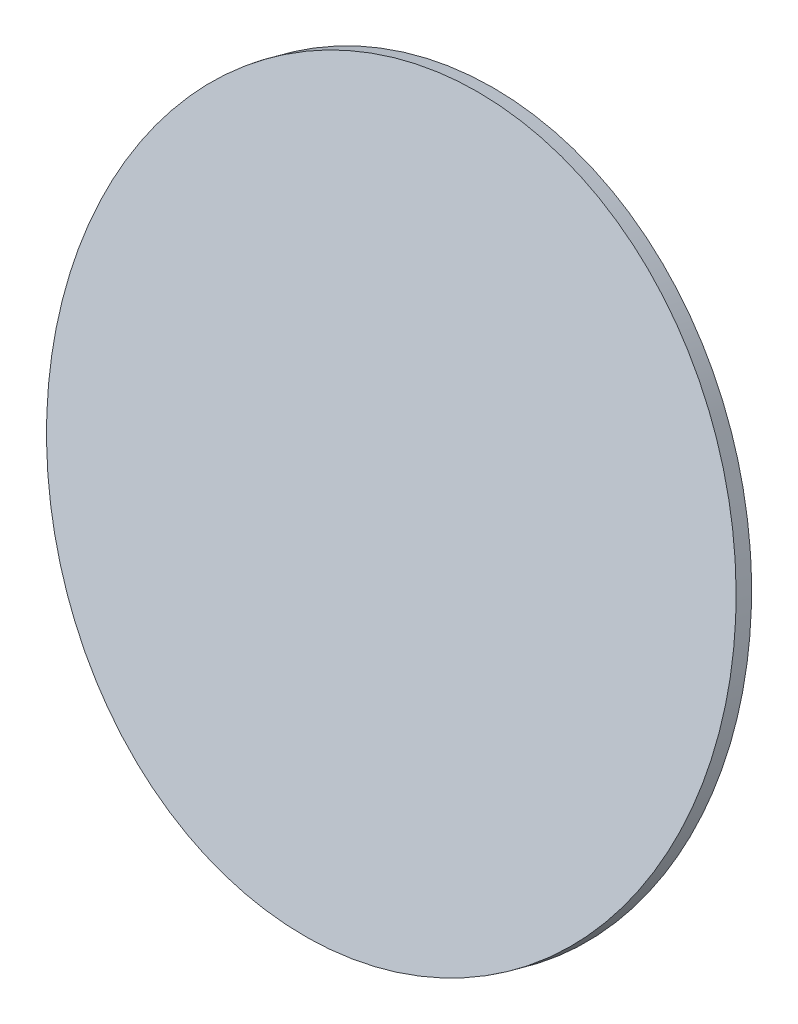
ISO-10303-21;
HEADER;
FILE_DESCRIPTION(('STEP AP214'),'2;1');
FILE_NAME('part.step','',(''),(''),'','','');
FILE_SCHEMA(('AUTOMOTIVE_DESIGN { 1 0 10303 214 1 1 1 1 }'));
ENDSEC;
DATA;
#1=APPLICATION_CONTEXT('core data for automotive mechanical design processes');
#2=APPLICATION_PROTOCOL_DEFINITION('international standard','automotive_design',2000,#1);
#3=PRODUCT_CONTEXT('',#1,'mechanical');
#4=PRODUCT('Part','Part','',(#3));
#5=PRODUCT_RELATED_PRODUCT_CATEGORY('part','',(#4));
#6=PRODUCT_DEFINITION_FORMATION('','',#4);
#7=PRODUCT_DEFINITION_CONTEXT('part definition',#1,'design');
#8=PRODUCT_DEFINITION('design','',#6,#7);
#9=PRODUCT_DEFINITION_SHAPE('','',#8);
#10=(LENGTH_UNIT() NAMED_UNIT(*) SI_UNIT(.MILLI.,.METRE.));
#11=(NAMED_UNIT(*) PLANE_ANGLE_UNIT() SI_UNIT($,.RADIAN.));
#12=(NAMED_UNIT(*) SI_UNIT($,.STERADIAN.) SOLID_ANGLE_UNIT());
#13=UNCERTAINTY_MEASURE_WITH_UNIT(LENGTH_MEASURE(1.E-05),#10,'distance_accuracy_value','');
#14=(GEOMETRIC_REPRESENTATION_CONTEXT(3) GLOBAL_UNCERTAINTY_ASSIGNED_CONTEXT((#13)) GLOBAL_UNIT_ASSIGNED_CONTEXT((#10,
#11,#12)) REPRESENTATION_CONTEXT('',''));
#15=CARTESIAN_POINT('',(0.,0.,0.));
#16=DIRECTION('',(0.,0.,1.));
#17=DIRECTION('',(1.,0.,0.));
#18=AXIS2_PLACEMENT_3D('',#15,#16,#17);
#19=CARTESIAN_POINT('',(16.7174292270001,101.217541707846,-79.615895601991));
#20=CARTESIAN_POINT('',(18.0849751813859,101.217541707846,-79.615895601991));
#21=CARTESIAN_POINT('',(20.8200670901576,100.957337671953,-79.5461741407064));
#22=CARTESIAN_POINT('',(24.7650428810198,99.8014187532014,-79.2364465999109));
#23=CARTESIAN_POINT('',(28.4007533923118,97.9243082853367,-78.7334763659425));
#24=CARTESIAN_POINT('',(31.5874803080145,95.3981425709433,-78.0565923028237));
#25=CARTESIAN_POINT('',(34.2027594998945,92.3200007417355,-77.231806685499));
#26=CARTESIAN_POINT('',(36.1460872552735,88.808174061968,-76.2908155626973));
#27=CARTESIAN_POINT('',(37.3427825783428,84.997620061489,-75.2697806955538));
#28=CARTESIAN_POINT('',(37.7468571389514,81.0347761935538,-74.2079398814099));
#29=CARTESIAN_POINT('',(37.3427825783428,77.0719323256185,-73.1460990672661));
#30=CARTESIAN_POINT('',(36.1460872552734,73.2613783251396,-72.1250642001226));
#31=CARTESIAN_POINT('',(34.2027594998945,69.749551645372,-71.1840730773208));
#32=CARTESIAN_POINT('',(31.5874803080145,66.6714098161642,-70.3592874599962));
#33=CARTESIAN_POINT('',(28.4007533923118,64.1452441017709,-69.6824033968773));
#34=CARTESIAN_POINT('',(24.7650428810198,62.268133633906,-69.1794331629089));
#35=CARTESIAN_POINT('',(20.8200670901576,61.112214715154,-68.8697056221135));
#36=CARTESIAN_POINT('',(16.717429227,60.7219086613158,-68.7651234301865));
#37=CARTESIAN_POINT('',(12.6147913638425,61.112214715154,-68.8697056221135));
#38=CARTESIAN_POINT('',(8.66981557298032,62.268133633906,-69.1794331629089));
#39=CARTESIAN_POINT('',(5.03410506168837,64.1452441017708,-69.6824033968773));
#40=CARTESIAN_POINT('',(1.84737814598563,66.6714098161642,-70.3592874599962));
#41=CARTESIAN_POINT('',(-0.767901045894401,69.749551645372,-71.1840730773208));
#42=CARTESIAN_POINT('',(-2.71122880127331,73.2613783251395,-72.1250642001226));
#43=CARTESIAN_POINT('',(-3.90792412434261,77.0719323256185,-73.1460990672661));
#44=CARTESIAN_POINT('',(-4.31199868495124,81.0347761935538,-74.2079398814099));
#45=CARTESIAN_POINT('',(-3.90792412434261,84.997620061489,-75.2697806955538));
#46=CARTESIAN_POINT('',(-2.71122880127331,88.808174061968,-76.2908155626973));
#47=CARTESIAN_POINT('',(-0.767901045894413,92.3200007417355,-77.2318066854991));
#48=CARTESIAN_POINT('',(1.84737814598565,95.3981425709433,-78.0565923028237));
#49=CARTESIAN_POINT('',(5.03410506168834,97.9243082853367,-78.7334763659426));
#50=CARTESIAN_POINT('',(8.66981557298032,99.8014187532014,-79.2364465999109));
#51=CARTESIAN_POINT('',(12.6147913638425,100.957337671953,-79.5461741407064));
#52=CARTESIAN_POINT('',(15.3498832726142,101.217541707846,-79.615895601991));
#53=CARTESIAN_POINT('',(16.7174292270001,101.217541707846,-79.615895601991));
#54=B_SPLINE_CURVE_WITH_KNOTS('',3,(#19,#20,#21,#22,#23,#24,#25,#26,#27,#28,#29,#30,#31,#32,#33,
#34,#35,#36,#37,#38,#39,#40,#41,#42,#43,#44,#45,#46,#47,#48,#49,#50,#51,#52,#53),.UNSPECIFIED.,
.T.,.F.,(4,1,1,1,1,1,1,1,1,1,1,1,1,1,1,1,1,1,1,1,1,1,1,1,1,1,1,1,1,1,1,1,4),(0.,0.03125,0.0625,
0.09375,0.125,0.15625,0.1875,0.21875,0.25,0.28125,0.3125,0.34375,0.375,0.40625,0.4375,0.46875,
0.5,0.53125,0.5625,0.59375,0.625,0.65625,0.6875,0.71875,0.75,0.78125,0.8125,0.84375,0.875,
0.90625,0.9375,0.96875,1.),.UNSPECIFIED.);
#55=DIRECTION('',(0.,-0.258819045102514,-0.96592582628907));
#56=VECTOR('',#55,1.);
#57=SURFACE_OF_LINEAR_EXTRUSION('',#54,#56);
#58=CARTESIAN_POINT('',(16.717429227,101.217541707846,-79.615895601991));
#59=CARTESIAN_POINT('',(16.9909395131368,101.217541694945,-79.6158955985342));
#60=CARTESIAN_POINT('',(17.2644486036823,101.212337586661,-79.6145011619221));
#61=CARTESIAN_POINT('',(17.8110463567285,101.191561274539,-79.6089341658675));
#62=CARTESIAN_POINT('',(18.0841350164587,101.175989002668,-79.6047615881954));
#63=CARTESIAN_POINT('',(18.6294711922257,101.134516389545,-79.5936490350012));
#64=CARTESIAN_POINT('',(18.9017187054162,101.108616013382,-79.5867090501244));
#65=CARTESIAN_POINT('',(19.4449525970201,101.046527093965,-79.5700723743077));
#66=CARTESIAN_POINT('',(19.7159389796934,101.010338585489,-79.5603756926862));
#67=CARTESIAN_POINT('',(20.2562306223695,100.927713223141,-79.538236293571));
#68=CARTESIAN_POINT('',(20.5255358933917,100.881276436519,-79.5257935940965));
#69=CARTESIAN_POINT('',(21.0620442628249,100.778194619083,-79.4981729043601));
#70=CARTESIAN_POINT('',(21.3292473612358,100.721549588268,-79.4829949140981));
#71=CARTESIAN_POINT('',(21.8611465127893,100.598170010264,-79.4499354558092));
#72=CARTESIAN_POINT('',(22.1258425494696,100.53143539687,-79.4320539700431));
#73=CARTESIAN_POINT('',(22.6523238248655,100.387995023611,-79.3936192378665));
#74=CARTESIAN_POINT('',(22.9141090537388,100.311289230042,-79.3730659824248));
#75=CARTESIAN_POINT('',(23.4343646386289,100.148024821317,-79.3293194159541));
#76=CARTESIAN_POINT('',(23.6928350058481,100.061466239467,-79.3061261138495));
#77=CARTESIAN_POINT('',(24.206057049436,99.8786144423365,-79.2571311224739));
#78=CARTESIAN_POINT('',(24.4608087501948,99.7823212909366,-79.2313294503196));
#79=CARTESIAN_POINT('',(24.9661885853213,99.5801190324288,-79.1771495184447));
#80=CARTESIAN_POINT('',(25.2168167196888,99.474209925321,-79.1487712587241));
#81=CARTESIAN_POINT('',(25.7135763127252,99.2529684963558,-79.0894897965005));
#82=CARTESIAN_POINT('',(25.9597077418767,99.1376361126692,-79.0585865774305));
#83=CARTESIAN_POINT('',(26.4471018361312,98.8977403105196,-78.9943066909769));
#84=CARTESIAN_POINT('',(26.6883644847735,98.7731768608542,-78.9609300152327));
#85=CARTESIAN_POINT('',(27.1656486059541,98.5150111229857,-78.8917547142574));
#86=CARTESIAN_POINT('',(27.4016700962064,98.3814088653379,-78.8559560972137));
#87=CARTESIAN_POINT('',(27.868099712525,98.1053575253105,-78.7819883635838));
#88=CARTESIAN_POINT('',(28.0985078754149,97.9629085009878,-78.743819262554));
#89=CARTESIAN_POINT('',(28.5533377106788,97.6693563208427,-78.6651621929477));
#90=CARTESIAN_POINT('',(28.777759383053,97.5182531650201,-78.6246742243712));
#91=CARTESIAN_POINT('',(29.2202892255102,97.2076520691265,-78.5414489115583));
#92=CARTESIAN_POINT('',(29.4383973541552,97.0481540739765,-78.4987115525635));
#93=CARTESIAN_POINT('',(29.8679739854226,96.7210219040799,-78.4110567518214));
#94=CARTESIAN_POINT('',(30.0794424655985,96.5533877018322,-78.3661393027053));
#95=CARTESIAN_POINT('',(30.4954133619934,96.2102417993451,-78.2741936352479));
#96=CARTESIAN_POINT('',(30.6999158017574,96.0347301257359,-78.2271654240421));
#97=CARTESIAN_POINT('',(31.1016283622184,95.6760877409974,-78.1310674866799));
#98=CARTESIAN_POINT('',(31.2988385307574,95.4929570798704,-78.0819977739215));
#99=CARTESIAN_POINT('',(31.685639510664,95.1193360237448,-77.9818863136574));
#100=CARTESIAN_POINT('',(31.8752303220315,94.9288456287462,-77.9308445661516));
#101=CARTESIAN_POINT('',(32.2465242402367,94.5408210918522,-77.8268737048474));
#102=CARTESIAN_POINT('',(32.4282272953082,94.3432869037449,-77.7739445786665));
#103=CARTESIAN_POINT('',(32.7834780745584,93.9414898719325,-77.6662833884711));
#104=CARTESIAN_POINT('',(32.9570257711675,93.7372270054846,-77.6115513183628));
#105=CARTESIAN_POINT('',(33.2956979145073,93.3222878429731,-77.5003687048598));
#106=CARTESIAN_POINT('',(33.4608223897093,93.1116115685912,-77.4439181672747));
#107=CARTESIAN_POINT('',(33.7823803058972,92.6841605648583,-77.3293830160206));
#108=CARTESIAN_POINT('',(33.9388138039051,92.4673858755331,-77.2712984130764));
#109=CARTESIAN_POINT('',(34.2427213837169,92.0280539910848,-77.1535797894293));
#110=CARTESIAN_POINT('',(34.3901954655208,91.8054967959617,-77.0939457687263));
#111=CARTESIAN_POINT('',(34.6759848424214,91.3549603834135,-76.9732249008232));
#112=CARTESIAN_POINT('',(34.8143000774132,91.1269811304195,-76.9121380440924));
#113=CARTESIAN_POINT('',(35.0815729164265,90.6659600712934,-76.7886078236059));
#114=CARTESIAN_POINT('',(35.2105304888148,90.4329182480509,-76.7261644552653));
#115=CARTESIAN_POINT('',(35.4588888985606,89.9621317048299,-76.6000175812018));
#116=CARTESIAN_POINT('',(35.5782897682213,89.7243870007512,-76.5363140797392));
#117=CARTESIAN_POINT('',(35.8073357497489,89.2445540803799,-76.4077432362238));
#118=CARTESIAN_POINT('',(35.9169809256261,89.0024658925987,-76.3428759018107));
#119=CARTESIAN_POINT('',(36.1263161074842,88.5143064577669,-76.2120739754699));
#120=CARTESIAN_POINT('',(36.2260061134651,88.2682352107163,-76.1461393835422));
#121=CARTESIAN_POINT('',(36.4153082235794,87.7725007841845,-76.0133077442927));
#122=CARTESIAN_POINT('',(36.5049202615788,87.5228375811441,-75.9464106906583));
#123=CARTESIAN_POINT('',(36.6739440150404,87.020309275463,-75.8117586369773));
#124=CARTESIAN_POINT('',(36.7533556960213,86.7674441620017,-75.7440036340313));
#125=CARTESIAN_POINT('',(36.9018560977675,86.258902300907,-75.6077402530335));
#126=CARTESIAN_POINT('',(36.9709448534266,86.0032255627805,-75.5392318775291));
#127=CARTESIAN_POINT('',(37.0986767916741,85.4894504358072,-75.4015662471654));
#128=CARTESIAN_POINT('',(37.1573200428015,85.2313520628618,-75.3324089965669));
#129=CARTESIAN_POINT('',(37.2640381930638,84.7131247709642,-75.1935504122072));
#130=CARTESIAN_POINT('',(37.3121130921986,84.452995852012,-75.123849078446));
#131=CARTESIAN_POINT('',(37.3976531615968,83.931114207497,-74.9840113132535));
#132=CARTESIAN_POINT('',(37.4351182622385,83.6693614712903,-74.9138748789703));
#133=CARTESIAN_POINT('',(37.4993974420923,83.1446378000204,-74.7732755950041));
#134=CARTESIAN_POINT('',(37.5262114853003,82.8816668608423,-74.7028127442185));
#135=CARTESIAN_POINT('',(37.5691470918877,82.3549126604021,-74.5616693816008));
#136=CARTESIAN_POINT('',(37.5852686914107,82.0911294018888,-74.4909888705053));
#137=CARTESIAN_POINT('',(37.6067779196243,81.5631561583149,-74.3495188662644));
#138=CARTESIAN_POINT('',(37.6121656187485,81.2989661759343,-74.2787293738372));
#139=CARTESIAN_POINT('',(37.6121656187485,80.7705862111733,-74.1371503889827));
#140=CARTESIAN_POINT('',(37.6067779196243,80.5063962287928,-74.0663608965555));
#141=CARTESIAN_POINT('',(37.5852686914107,79.9784229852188,-73.9248908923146));
#142=CARTESIAN_POINT('',(37.5691470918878,79.7146397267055,-73.8542103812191));
#143=CARTESIAN_POINT('',(37.5262114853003,79.1878855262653,-73.7130670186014));
#144=CARTESIAN_POINT('',(37.4993974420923,78.9249145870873,-73.6426041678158));
#145=CARTESIAN_POINT('',(37.4351182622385,78.4001909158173,-73.5020048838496));
#146=CARTESIAN_POINT('',(37.3976531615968,78.1384381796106,-73.4318684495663));
#147=CARTESIAN_POINT('',(37.3121130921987,77.6165565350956,-73.2920306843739));
#148=CARTESIAN_POINT('',(37.2640381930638,77.3564276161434,-73.2223293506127));
#149=CARTESIAN_POINT('',(37.1573200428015,76.8382003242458,-73.083470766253));
#150=CARTESIAN_POINT('',(37.0986767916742,76.5801019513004,-73.0143135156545));
#151=CARTESIAN_POINT('',(36.9709448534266,76.0663268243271,-72.8766478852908));
#152=CARTESIAN_POINT('',(36.9018560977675,75.8106500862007,-72.8081395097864));
#153=CARTESIAN_POINT('',(36.7533556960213,75.3021082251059,-72.6718761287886));
#154=CARTESIAN_POINT('',(36.6739440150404,75.0492431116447,-72.6041211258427));
#155=CARTESIAN_POINT('',(36.5049202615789,74.5467148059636,-72.4694690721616));
#156=CARTESIAN_POINT('',(36.4153082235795,74.2970516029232,-72.4025720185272));
#157=CARTESIAN_POINT('',(36.2260061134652,73.8013171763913,-72.2697403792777));
#158=CARTESIAN_POINT('',(36.1263161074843,73.5552459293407,-72.20380578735));
#159=CARTESIAN_POINT('',(35.9169809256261,73.067086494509,-72.0730038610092));
#160=CARTESIAN_POINT('',(35.8073357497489,72.8249983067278,-72.0081365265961));
#161=CARTESIAN_POINT('',(35.5782897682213,72.3451653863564,-71.8795656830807));
#162=CARTESIAN_POINT('',(35.4588888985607,72.1074206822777,-71.815862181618));
#163=CARTESIAN_POINT('',(35.2105304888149,71.6366341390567,-71.6897153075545));
#164=CARTESIAN_POINT('',(35.0815729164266,71.4035923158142,-71.627271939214));
#165=CARTESIAN_POINT('',(34.8143000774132,70.9425712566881,-71.5037417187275));
#166=CARTESIAN_POINT('',(34.6759848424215,70.7145920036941,-71.4426548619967));
#167=CARTESIAN_POINT('',(34.3901954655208,70.264055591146,-71.3219339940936));
#168=CARTESIAN_POINT('',(34.2427213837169,70.0414983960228,-71.2622999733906));
#169=CARTESIAN_POINT('',(33.9388138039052,69.6021665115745,-71.1445813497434));
#170=CARTESIAN_POINT('',(33.7823803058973,69.3853918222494,-71.0864967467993));
#171=CARTESIAN_POINT('',(33.4608223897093,68.9579408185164,-70.9719615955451));
#172=CARTESIAN_POINT('',(33.2956979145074,68.7472645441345,-70.9155110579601));
#173=CARTESIAN_POINT('',(32.9570257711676,68.3323253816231,-70.8043284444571));
#174=CARTESIAN_POINT('',(32.7834780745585,68.1280625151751,-70.7495963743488));
#175=CARTESIAN_POINT('',(32.4282272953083,67.7262654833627,-70.6419351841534));
#176=CARTESIAN_POINT('',(32.2465242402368,67.5287312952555,-70.5890060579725));
#177=CARTESIAN_POINT('',(31.8752303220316,67.1407067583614,-70.4850351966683));
#178=CARTESIAN_POINT('',(31.685639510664,66.9502163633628,-70.4339934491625));
#179=CARTESIAN_POINT('',(31.2988385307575,66.5765953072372,-70.3338819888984));
#180=CARTESIAN_POINT('',(31.1016283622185,66.3934646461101,-70.28481227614));
#181=CARTESIAN_POINT('',(30.6999158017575,66.0348222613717,-70.1887143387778));
#182=CARTESIAN_POINT('',(30.4954133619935,65.8593105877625,-70.141686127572));
#183=CARTESIAN_POINT('',(30.0794424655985,65.5161646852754,-70.0497404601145));
#184=CARTESIAN_POINT('',(29.8679739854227,65.3485304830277,-70.0048230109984));
#185=CARTESIAN_POINT('',(29.4383973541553,65.0213983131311,-69.9171682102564));
#186=CARTESIAN_POINT('',(29.2202892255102,64.8619003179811,-69.8744308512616));
#187=CARTESIAN_POINT('',(28.7777593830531,64.5512992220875,-69.7912055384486));
#188=CARTESIAN_POINT('',(28.5533377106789,64.4001960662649,-69.7507175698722));
#189=CARTESIAN_POINT('',(28.098507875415,64.1066438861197,-69.6720605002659));
#190=CARTESIAN_POINT('',(27.8680997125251,63.9641948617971,-69.633891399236));
#191=CARTESIAN_POINT('',(27.4016700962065,63.6881435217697,-69.5599236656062));
#192=CARTESIAN_POINT('',(27.1656486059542,63.5545412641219,-69.5241250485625));
#193=CARTESIAN_POINT('',(26.6883644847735,63.2963755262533,-69.4549497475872));
#194=CARTESIAN_POINT('',(26.4471018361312,63.1718120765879,-69.4215730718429));
#195=CARTESIAN_POINT('',(25.9597077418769,62.9319162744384,-69.3572931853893));
#196=CARTESIAN_POINT('',(25.7135763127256,62.8165838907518,-69.3263899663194));
#197=CARTESIAN_POINT('',(25.2168167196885,62.5953424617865,-69.2671085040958));
#198=CARTESIAN_POINT('',(24.9661885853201,62.4894333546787,-69.2387302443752));
#199=CARTESIAN_POINT('',(24.4608087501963,62.287231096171,-69.1845503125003));
#200=CARTESIAN_POINT('',(24.206057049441,62.1909379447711,-69.1587486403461));
#201=CARTESIAN_POINT('',(23.6928350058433,62.0080861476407,-69.1097536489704));
#202=CARTESIAN_POINT('',(23.4343646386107,61.9215275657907,-69.0865603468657));
#203=CARTESIAN_POINT('',(22.9141090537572,61.7582631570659,-69.0428137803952));
#204=CARTESIAN_POINT('',(22.6523238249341,61.6815573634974,-69.0222605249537));
#205=CARTESIAN_POINT('',(22.1258425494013,61.5381169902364,-68.9838257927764));
#206=CARTESIAN_POINT('',(21.861146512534,61.4713823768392,-68.9659443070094));
#207=CARTESIAN_POINT('',(21.3292473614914,61.3480027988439,-68.932884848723));
#208=CARTESIAN_POINT('',(21.0620442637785,61.2913577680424,-68.9177068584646));
#209=CARTESIAN_POINT('',(20.5255358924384,61.1882759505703,-68.8900861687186));
#210=CARTESIAN_POINT('',(20.2562306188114,61.1418391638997,-68.8776434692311));
#211=CARTESIAN_POINT('',(19.7159389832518,61.0592138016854,-68.8555040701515));
#212=CARTESIAN_POINT('',(19.4449526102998,61.0230252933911,-68.8458073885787));
#213=CARTESIAN_POINT('',(18.9017186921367,60.9609363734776,-68.829170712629));
#214=CARTESIAN_POINT('',(18.6294711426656,60.9350359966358,-68.8222307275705));
#215=CARTESIAN_POINT('',(18.0841350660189,60.8935633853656,-68.8111181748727));
#216=CARTESIAN_POINT('',(17.8110465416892,60.8779911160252,-68.8069455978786));
#217=CARTESIAN_POINT('',(17.2644484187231,60.8572147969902,-68.8013785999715));
#218=CARTESIAN_POINT('',(16.9909388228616,60.8520106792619,-68.7999841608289));
#219=CARTESIAN_POINT('',(16.4439196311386,60.8520106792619,-68.7999841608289));
#220=CARTESIAN_POINT('',(16.1704100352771,60.8572147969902,-68.8013785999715));
#221=CARTESIAN_POINT('',(15.6238119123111,60.8779911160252,-68.8069455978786));
#222=CARTESIAN_POINT('',(15.3507233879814,60.8935633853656,-68.8111181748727));
#223=CARTESIAN_POINT('',(14.8053873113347,60.9350359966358,-68.8222307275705));
#224=CARTESIAN_POINT('',(14.5331397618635,60.9609363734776,-68.829170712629));
#225=CARTESIAN_POINT('',(13.9899058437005,61.0230252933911,-68.8458073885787));
#226=CARTESIAN_POINT('',(13.7189194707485,61.0592138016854,-68.8555040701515));
#227=CARTESIAN_POINT('',(13.1786278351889,61.1418391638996,-68.8776434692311));
#228=CARTESIAN_POINT('',(12.9093225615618,61.1882759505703,-68.8900861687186));
#229=CARTESIAN_POINT('',(12.3728141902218,61.2913577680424,-68.9177068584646));
#230=CARTESIAN_POINT('',(12.1056110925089,61.3480027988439,-68.932884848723));
#231=CARTESIAN_POINT('',(11.5737119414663,61.4713823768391,-68.9659443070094));
#232=CARTESIAN_POINT('',(11.309015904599,61.5381169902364,-68.9838257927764));
#233=CARTESIAN_POINT('',(10.7825346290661,61.6815573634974,-69.0222605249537));
#234=CARTESIAN_POINT('',(10.520749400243,61.7582631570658,-69.0428137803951));
#235=CARTESIAN_POINT('',(10.0004938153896,61.9215275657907,-69.0865603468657));
#236=CARTESIAN_POINT('',(9.74202344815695,62.0080861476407,-69.1097536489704));
#237=CARTESIAN_POINT('',(9.22880140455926,62.1909379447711,-69.158748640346));
#238=CARTESIAN_POINT('',(8.97404970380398,62.2872310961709,-69.1845503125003));
#239=CARTESIAN_POINT('',(8.46866986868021,62.4894333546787,-69.2387302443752));
#240=CARTESIAN_POINT('',(8.21804173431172,62.5953424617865,-69.2671085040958));
#241=CARTESIAN_POINT('',(7.72128214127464,62.8165838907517,-69.3263899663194));
#242=CARTESIAN_POINT('',(7.47515071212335,62.9319162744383,-69.3572931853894));
#243=CARTESIAN_POINT('',(6.98775661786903,63.1718120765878,-69.4215730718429));
#244=CARTESIAN_POINT('',(6.74649396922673,63.2963755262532,-69.4549497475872));
#245=CARTESIAN_POINT('',(6.26920984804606,63.5545412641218,-69.5241250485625));
#246=CARTESIAN_POINT('',(6.03318835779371,63.6881435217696,-69.5599236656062));
#247=CARTESIAN_POINT('',(5.56675874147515,63.964194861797,-69.633891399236));
#248=CARTESIAN_POINT('',(5.33635057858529,64.1066438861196,-69.6720605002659));
#249=CARTESIAN_POINT('',(4.8815207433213,64.4001960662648,-69.7507175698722));
#250=CARTESIAN_POINT('',(4.65709907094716,64.5512992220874,-69.7912055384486));
#251=CARTESIAN_POINT('',(4.21456922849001,64.861900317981,-69.8744308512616));
#252=CARTESIAN_POINT('',(3.99646109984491,65.021398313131,-69.9171682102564));
#253=CARTESIAN_POINT('',(3.56688446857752,65.3485304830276,-70.0048230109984));
#254=CARTESIAN_POINT('',(3.3554159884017,65.5161646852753,-70.0497404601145));
#255=CARTESIAN_POINT('',(2.93944509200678,65.8593105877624,-70.141686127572));
#256=CARTESIAN_POINT('',(2.73494265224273,66.0348222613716,-70.1887143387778));
#257=CARTESIAN_POINT('',(2.3332300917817,66.3934646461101,-70.28481227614));
#258=CARTESIAN_POINT('',(2.13601992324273,66.5765953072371,-70.3338819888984));
#259=CARTESIAN_POINT('',(1.74921894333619,66.9502163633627,-70.4339934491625));
#260=CARTESIAN_POINT('',(1.55962813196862,67.1407067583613,-70.4850351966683));
#261=CARTESIAN_POINT('',(1.18833421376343,67.5287312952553,-70.5890060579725));
#262=CARTESIAN_POINT('',(1.00663115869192,67.7262654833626,-70.6419351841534));
#263=CARTESIAN_POINT('',(0.651380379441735,68.128062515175,-70.7495963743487));
#264=CARTESIAN_POINT('',(0.477832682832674,68.3323253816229,-70.8043284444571));
#265=CARTESIAN_POINT('',(0.139160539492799,68.7472645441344,-70.9155110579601));
#266=CARTESIAN_POINT('',(-0.0259639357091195,68.9579408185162,-70.9719615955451));
#267=CARTESIAN_POINT('',(-0.347521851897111,69.3853918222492,-71.0864967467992));
#268=CARTESIAN_POINT('',(-0.503955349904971,69.6021665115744,-71.1445813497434));
#269=CARTESIAN_POINT('',(-0.80786292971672,70.0414983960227,-71.2622999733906));
#270=CARTESIAN_POINT('',(-0.955337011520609,70.2640555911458,-71.3219339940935));
#271=CARTESIAN_POINT('',(-1.24112638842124,70.714592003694,-71.4426548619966));
#272=CARTESIAN_POINT('',(-1.37944162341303,70.942571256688,-71.5037417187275));
#273=CARTESIAN_POINT('',(-1.64671446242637,71.4035923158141,-71.627271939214));
#274=CARTESIAN_POINT('',(-1.77567203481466,71.6366341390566,-71.6897153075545));
#275=CARTESIAN_POINT('',(-2.02403044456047,72.1074206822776,-71.815862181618));
#276=CARTESIAN_POINT('',(-2.14343131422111,72.3451653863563,-71.8795656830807));
#277=CARTESIAN_POINT('',(-2.37247729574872,72.8249983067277,-72.0081365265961));
#278=CARTESIAN_POINT('',(-2.48212247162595,73.0670864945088,-72.0730038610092));
#279=CARTESIAN_POINT('',(-2.69145765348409,73.5552459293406,-72.20380578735));
#280=CARTESIAN_POINT('',(-2.79114765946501,73.8013171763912,-72.2697403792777));
#281=CARTESIAN_POINT('',(-2.98044976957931,74.297051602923,-72.4025720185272));
#282=CARTESIAN_POINT('',(-3.07006180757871,74.5467148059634,-72.4694690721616));
#283=CARTESIAN_POINT('',(-3.23908556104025,75.0492431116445,-72.6041211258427));
#284=CARTESIAN_POINT('',(-3.31849724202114,75.3021082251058,-72.6718761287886));
#285=CARTESIAN_POINT('',(-3.46699764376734,75.8106500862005,-72.8081395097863));
#286=CARTESIAN_POINT('',(-3.53608639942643,76.066326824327,-72.8766478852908));
#287=CARTESIAN_POINT('',(-3.663818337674,76.5801019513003,-73.0143135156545));
#288=CARTESIAN_POINT('',(-3.72246158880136,76.8382003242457,-73.083470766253));
#289=CARTESIAN_POINT('',(-3.82917973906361,77.3564276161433,-73.2223293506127));
#290=CARTESIAN_POINT('',(-3.8772546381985,77.6165565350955,-73.2920306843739));
#291=CARTESIAN_POINT('',(-3.96279470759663,78.1384381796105,-73.4318684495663));
#292=CARTESIAN_POINT('',(-4.00025980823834,78.4001909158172,-73.5020048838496));
#293=CARTESIAN_POINT('',(-4.06453898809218,78.9249145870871,-73.6426041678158));
#294=CARTESIAN_POINT('',(-4.09135303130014,79.1878855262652,-73.7130670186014));
#295=CARTESIAN_POINT('',(-4.13428863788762,79.7146397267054,-73.854210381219));
#296=CARTESIAN_POINT('',(-4.15041023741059,79.9784229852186,-73.9248908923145));
#297=CARTESIAN_POINT('',(-4.17191946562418,80.5063962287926,-74.0663608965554));
#298=CARTESIAN_POINT('',(-4.17730716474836,80.7705862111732,-74.1371503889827));
#299=CARTESIAN_POINT('',(-4.17730716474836,81.2989661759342,-74.2787293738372));
#300=CARTESIAN_POINT('',(-4.17191946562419,81.5631561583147,-74.3495188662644));
#301=CARTESIAN_POINT('',(-4.1504102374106,82.0911294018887,-74.4909888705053));
#302=CARTESIAN_POINT('',(-4.13428863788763,82.354912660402,-74.5616693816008));
#303=CARTESIAN_POINT('',(-4.09135303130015,82.8816668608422,-74.7028127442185));
#304=CARTESIAN_POINT('',(-4.06453898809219,83.1446378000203,-74.7732755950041));
#305=CARTESIAN_POINT('',(-4.00025980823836,83.6693614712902,-74.9138748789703));
#306=CARTESIAN_POINT('',(-3.96279470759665,83.9311142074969,-74.9840113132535));
#307=CARTESIAN_POINT('',(-3.87725463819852,84.4529958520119,-75.123849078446));
#308=CARTESIAN_POINT('',(-3.82917973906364,84.7131247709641,-75.1935504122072));
#309=CARTESIAN_POINT('',(-3.72246158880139,85.2313520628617,-75.3324089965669));
#310=CARTESIAN_POINT('',(-3.66381833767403,85.4894504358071,-75.4015662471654));
#311=CARTESIAN_POINT('',(-3.53608639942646,86.0032255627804,-75.5392318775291));
#312=CARTESIAN_POINT('',(-3.46699764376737,86.2589023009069,-75.6077402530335));
#313=CARTESIAN_POINT('',(-3.31849724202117,86.7674441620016,-75.7440036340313));
#314=CARTESIAN_POINT('',(-3.23908556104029,87.0203092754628,-75.8117586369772));
#315=CARTESIAN_POINT('',(-3.07006180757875,87.5228375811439,-75.9464106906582));
#316=CARTESIAN_POINT('',(-2.98044976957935,87.7725007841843,-76.0133077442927));
#317=CARTESIAN_POINT('',(-2.79114765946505,88.2682352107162,-76.1461393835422));
#318=CARTESIAN_POINT('',(-2.69145765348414,88.5143064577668,-76.2120739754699));
#319=CARTESIAN_POINT('',(-2.482122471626,89.0024658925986,-76.3428759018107));
#320=CARTESIAN_POINT('',(-2.37247729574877,89.2445540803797,-76.4077432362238));
#321=CARTESIAN_POINT('',(-2.14343131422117,89.7243870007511,-76.5363140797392));
#322=CARTESIAN_POINT('',(-2.02403044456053,89.9621317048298,-76.6000175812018));
#323=CARTESIAN_POINT('',(-1.77567203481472,90.4329182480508,-76.7261644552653));
#324=CARTESIAN_POINT('',(-1.64671446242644,90.6659600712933,-76.7886078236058));
#325=CARTESIAN_POINT('',(-1.37944162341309,91.1269811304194,-76.9121380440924));
#326=CARTESIAN_POINT('',(-1.2411263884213,91.3549603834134,-76.9732249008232));
#327=CARTESIAN_POINT('',(-0.955337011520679,91.8054967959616,-77.0939457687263));
#328=CARTESIAN_POINT('',(-0.807862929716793,92.0280539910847,-77.1535797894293));
#329=CARTESIAN_POINT('',(-0.503955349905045,92.467385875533,-77.2712984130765));
#330=CARTESIAN_POINT('',(-0.347521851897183,92.6841605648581,-77.3293830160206));
#331=CARTESIAN_POINT('',(-0.0259639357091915,93.1116115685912,-77.4439181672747));
#332=CARTESIAN_POINT('',(0.139160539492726,93.322287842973,-77.5003687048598));
#333=CARTESIAN_POINT('',(0.477832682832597,93.7372270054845,-77.6115513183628));
#334=CARTESIAN_POINT('',(0.651380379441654,93.9414898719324,-77.6662833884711));
#335=CARTESIAN_POINT('',(1.00663115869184,94.3432869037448,-77.7739445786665));
#336=CARTESIAN_POINT('',(1.18833421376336,94.540821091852,-77.8268737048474));
#337=CARTESIAN_POINT('',(1.55962813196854,94.928845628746,-77.9308445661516));
#338=CARTESIAN_POINT('',(1.74921894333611,95.1193360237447,-77.9818863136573));
#339=CARTESIAN_POINT('',(2.13601992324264,95.4929570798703,-78.0819977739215));
#340=CARTESIAN_POINT('',(2.33323009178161,95.6760877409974,-78.1310674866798));
#341=CARTESIAN_POINT('',(2.73494265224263,96.0347301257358,-78.2271654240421));
#342=CARTESIAN_POINT('',(2.93944509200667,96.210241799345,-78.2741936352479));
#343=CARTESIAN_POINT('',(3.35541598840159,96.5533877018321,-78.3661393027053));
#344=CARTESIAN_POINT('',(3.56688446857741,96.7210219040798,-78.4110567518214));
#345=CARTESIAN_POINT('',(3.99646109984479,97.0481540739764,-78.4987115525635));
#346=CARTESIAN_POINT('',(4.21456922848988,97.2076520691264,-78.5414489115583));
#347=CARTESIAN_POINT('',(4.65709907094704,97.5182531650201,-78.6246742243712));
#348=CARTESIAN_POINT('',(4.88152074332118,97.6693563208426,-78.6651621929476));
#349=CARTESIAN_POINT('',(5.33635057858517,97.9629085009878,-78.7438192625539));
#350=CARTESIAN_POINT('',(5.56675874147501,98.1053575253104,-78.7819883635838));
#351=CARTESIAN_POINT('',(6.03318835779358,98.3814088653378,-78.8559560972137));
#352=CARTESIAN_POINT('',(6.26920984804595,98.5150111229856,-78.8917547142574));
#353=CARTESIAN_POINT('',(6.74649396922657,98.7731768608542,-78.9609300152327));
#354=CARTESIAN_POINT('',(6.9877566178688,98.8977403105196,-78.9943066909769));
#355=CARTESIAN_POINT('',(7.47515071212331,99.1376361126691,-79.0585865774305));
#356=CARTESIAN_POINT('',(7.72128214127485,99.2529684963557,-79.0894897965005));
#357=CARTESIAN_POINT('',(8.21804173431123,99.4742099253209,-79.1487712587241));
#358=CARTESIAN_POINT('',(8.46866986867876,99.5801190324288,-79.1771495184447));
#359=CARTESIAN_POINT('',(8.97404970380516,99.7823212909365,-79.2313294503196));
#360=CARTESIAN_POINT('',(9.22880140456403,99.8786144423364,-79.2571311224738));
#361=CARTESIAN_POINT('',(9.74202344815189,100.061466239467,-79.3061261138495));
#362=CARTESIAN_POINT('',(10.0004938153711,100.148024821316,-79.3293194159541));
#363=CARTESIAN_POINT('',(10.5207494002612,100.311289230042,-79.3730659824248));
#364=CARTESIAN_POINT('',(10.7825346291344,100.387995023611,-79.3936192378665));
#365=CARTESIAN_POINT('',(11.3090159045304,100.53143539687,-79.4320539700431));
#366=CARTESIAN_POINT('',(11.5737119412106,100.598170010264,-79.4499354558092));
#367=CARTESIAN_POINT('',(12.1056110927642,100.721549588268,-79.4829949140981));
#368=CARTESIAN_POINT('',(12.3728141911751,100.778194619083,-79.4981729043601));
#369=CARTESIAN_POINT('',(12.9093225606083,100.881276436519,-79.5257935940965));
#370=CARTESIAN_POINT('',(13.1786278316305,100.927713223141,-79.538236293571));
#371=CARTESIAN_POINT('',(13.7189194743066,101.010338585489,-79.5603756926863));
#372=CARTESIAN_POINT('',(13.9899058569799,101.046527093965,-79.5700723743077));
#373=CARTESIAN_POINT('',(14.5331397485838,101.108616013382,-79.5867090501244));
#374=CARTESIAN_POINT('',(14.8053872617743,101.134516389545,-79.5936490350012));
#375=CARTESIAN_POINT('',(15.3507234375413,101.175989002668,-79.6047615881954));
#376=CARTESIAN_POINT('',(15.6238120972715,101.191561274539,-79.6089341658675));
#377=CARTESIAN_POINT('',(16.1704098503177,101.212337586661,-79.6145011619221));
#378=CARTESIAN_POINT('',(16.4439189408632,101.217541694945,-79.6158955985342));
#379=CARTESIAN_POINT('',(16.717429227,101.217541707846,-79.615895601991));
#380=B_SPLINE_CURVE_WITH_KNOTS('',3,(#58,#59,#60,#61,#62,#63,#64,#65,#66,#67,#68,#69,#70,#71,
#72,#73,#74,#75,#76,#77,#78,#79,#80,#81,#82,#83,#84,#85,#86,#87,#88,#89,#90,#91,#92,#93,#94,#95,
#96,#97,#98,#99,#100,#101,#102,#103,#104,#105,#106,#107,#108,#109,#110,#111,#112,#113,#114,#115,
#116,#117,#118,#119,#120,#121,#122,#123,#124,#125,#126,#127,#128,#129,#130,#131,#132,#133,#134,
#135,#136,#137,#138,#139,#140,#141,#142,#143,#144,#145,#146,#147,#148,#149,#150,#151,#152,#153,
#154,#155,#156,#157,#158,#159,#160,#161,#162,#163,#164,#165,#166,#167,#168,#169,#170,#171,#172,
#173,#174,#175,#176,#177,#178,#179,#180,#181,#182,#183,#184,#185,#186,#187,#188,#189,#190,#191,
#192,#193,#194,#195,#196,#197,#198,#199,#200,#201,#202,#203,#204,#205,#206,#207,#208,#209,#210,
#211,#212,#213,#214,#215,#216,#217,#218,#219,#220,#221,#222,#223,#224,#225,#226,#227,#228,#229,
#230,#231,#232,#233,#234,#235,#236,#237,#238,#239,#240,#241,#242,#243,#244,#245,#246,#247,#248,
#249,#250,#251,#252,#253,#254,#255,#256,#257,#258,#259,#260,#261,#262,#263,#264,#265,#266,#267,
#268,#269,#270,#271,#272,#273,#274,#275,#276,#277,#278,#279,#280,#281,#282,#283,#284,#285,#286,
#287,#288,#289,#290,#291,#292,#293,#294,#295,#296,#297,#298,#299,#300,#301,#302,#303,#304,#305,
#306,#307,#308,#309,#310,#311,#312,#313,#314,#315,#316,#317,#318,#319,#320,#321,#322,#323,#324,
#325,#326,#327,#328,#329,#330,#331,#332,#333,#334,#335,#336,#337,#338,#339,#340,#341,#342,#343,
#344,#345,#346,#347,#348,#349,#350,#351,#352,#353,#354,#355,#356,#357,#358,#359,#360,#361,#362,
#363,#364,#365,#366,#367,#368,#369,#370,#371,#372,#373,#374,#375,#376,#377,#378,#379),
.UNSPECIFIED.,.F.,.F.,(4,2,2,2,2,2,2,2,2,2,2,2,2,2,2,2,2,2,2,2,2,2,2,2,2,2,2,2,2,2,2,2,2,2,2,2,
2,2,2,2,2,2,2,2,2,2,2,2,2,2,2,2,2,2,2,2,2,2,2,2,2,2,2,2,2,2,2,2,2,2,2,2,2,2,2,2,2,2,2,2,2,2,2,2,
2,2,2,2,2,2,2,2,2,2,2,2,2,2,2,2,2,2,2,2,2,2,2,2,2,2,2,2,2,2,2,2,2,2,2,2,2,2,2,2,2,2,2,2,2,2,2,2,
2,2,2,2,2,2,2,2,2,2,2,2,2,2,2,2,2,2,2,2,2,2,2,2,2,2,2,2,4),(0.,0.820476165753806,
1.64095771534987,2.46144203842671,3.28192358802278,4.10239975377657,4.92287591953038,
5.74335746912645,6.56384179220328,7.38432334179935,8.20479950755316,9.02527567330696,
9.84575722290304,10.6662415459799,11.4867230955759,12.3071992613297,13.1276754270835,
13.9481569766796,14.7686412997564,15.5891228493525,16.4095990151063,17.2300751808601,
18.0505567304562,18.871041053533,19.6915226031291,20.5119987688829,21.3324749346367,
22.1529564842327,22.9734408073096,23.7939223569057,24.6143985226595,25.4348746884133,
26.2553562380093,27.0758405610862,27.8963221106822,28.716798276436,29.5372744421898,
30.3577559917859,31.1782403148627,31.9987218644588,32.8191980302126,33.6396741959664,
34.4601557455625,35.2806400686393,36.1011216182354,36.9215977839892,37.742073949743,
38.5625554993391,39.3830398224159,40.203521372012,41.0239975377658,41.8444737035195,
42.6649552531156,43.4854395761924,44.3059211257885,45.1263972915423,45.9468734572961,
46.7673550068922,47.587839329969,48.4083208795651,49.2287970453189,50.0492732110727,
50.8697547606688,51.6902390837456,52.5107206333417,53.3311967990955,54.1516729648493,
54.9721545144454,55.7926388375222,56.6131203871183,57.4335965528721,58.2540727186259,
59.0745542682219,59.8950385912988,60.7155201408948,61.5359963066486,62.3564724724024,
63.1769540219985,63.9974383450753,64.8179198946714,65.6383960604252,66.458872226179,
67.2793537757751,68.0998380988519,68.920319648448,69.7407958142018,70.5612719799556,
71.3817535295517,72.2022378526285,73.0227194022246,73.8431955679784,74.6636717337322,
75.4841532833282,76.304637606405,77.1251191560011,77.9455953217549,78.7660714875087,
79.5865530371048,80.4070373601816,81.2275189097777,82.0479950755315,82.8684712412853,
83.6889527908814,84.5094371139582,85.3299186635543,86.1503948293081,86.9708709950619,
87.791352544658,88.6118368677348,89.4323184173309,90.2527945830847,91.0732707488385,
91.8937522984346,92.7142366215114,93.5347181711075,94.3551943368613,95.1756705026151,
95.9961520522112,96.816636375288,97.637117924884,98.4575940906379,99.2780702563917,
100.098551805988,100.919036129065,101.739517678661,102.559993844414,103.380470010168,
104.200951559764,105.021435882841,105.841917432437,106.662393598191,107.482869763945,
108.303351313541,109.123835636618,109.944317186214,110.764793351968,111.585269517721,
112.405751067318,113.226235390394,114.04671693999,114.867193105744,115.687669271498,
116.508150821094,117.328635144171,118.149116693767,118.969592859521,119.790069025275,
120.610550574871,121.431034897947,122.251516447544,123.071992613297,123.892468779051,
124.712950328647,125.533434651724,126.35391620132,127.174392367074,127.994868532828,
128.815350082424,129.635834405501,130.456315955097,131.276792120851),.UNSPECIFIED.);
#381=CARTESIAN_POINT('',(16.717429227,101.217541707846,-79.615895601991));
#382=VERTEX_POINT('',#381);
#383=EDGE_CURVE('E8',#382,#382,#380,.T.);
#384=ORIENTED_EDGE('',*,*,#383,.T.);
#385=EDGE_LOOP('',(#384));
#386=FACE_BOUND('',#385,.T.);
#387=CARTESIAN_POINT('',(16.717429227,100.958722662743,-80.5818214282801));
#388=CARTESIAN_POINT('',(16.3859010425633,100.958722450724,-80.5818213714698));
#389=CARTESIAN_POINT('',(16.0543750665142,100.951076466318,-80.5797726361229));
#390=CARTESIAN_POINT('',(15.3920718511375,100.920563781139,-80.5715967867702));
#391=CARTESIAN_POINT('',(15.0612946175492,100.897696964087,-80.5654696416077));
#392=CARTESIAN_POINT('',(14.4012380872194,100.836813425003,-80.5491559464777));
#393=CARTESIAN_POINT('',(14.0719587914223,100.798796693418,-80.5389693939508));
#394=CARTESIAN_POINT('',(13.4156449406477,100.707686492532,-80.5145564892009));
#395=CARTESIAN_POINT('',(13.0886103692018,100.65459313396,-80.5003301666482));
#396=CARTESIAN_POINT('',(12.4375373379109,100.533392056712,-80.4678544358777));
#397=CARTESIAN_POINT('',(12.1134988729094,100.46528436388,-80.4496050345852));
#398=CARTESIAN_POINT('',(11.4691422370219,100.31425316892,-80.4091363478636));
#399=CARTESIAN_POINT('',(11.1488240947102,100.231329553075,-80.3869170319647));
#400=CARTESIAN_POINT('',(10.5126265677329,100.050879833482,-80.3385656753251));
#401=CARTESIAN_POINT('',(10.1967471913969,99.9533537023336,-80.3124336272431));
#402=CARTESIAN_POINT('',(9.57014500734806,99.7439119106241,-80.2563138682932));
#403=CARTESIAN_POINT('',(9.25942216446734,99.6319963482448,-80.2263261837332));
#404=CARTESIAN_POINT('',(8.64385868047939,99.3939739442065,-80.1625482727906));
#405=CARTESIAN_POINT('',(8.33901801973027,99.2678671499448,-80.1287580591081));
#406=CARTESIAN_POINT('',(7.73589628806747,99.0017776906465,-80.0574596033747));
#407=CARTESIAN_POINT('',(7.43761526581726,98.8617949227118,-80.0199513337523));
#408=CARTESIAN_POINT('',(6.84827283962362,98.5683018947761,-79.9413101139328));
#409=CARTESIAN_POINT('',(6.55721145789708,98.4147915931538,-79.9001771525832));
#410=CARTESIAN_POINT('',(5.98296957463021,98.0945870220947,-79.8143785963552));
#411=CARTESIAN_POINT('',(5.6997890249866,97.9278928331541,-79.7697130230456));
#412=CARTESIAN_POINT('',(5.14198082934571,97.5816504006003,-79.6769376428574));
#413=CARTESIAN_POINT('',(4.8673531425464,97.4021022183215,-79.6288278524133));
#414=CARTESIAN_POINT('',(4.32726292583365,97.0305724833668,-79.5292767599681));
#415=CARTESIAN_POINT('',(4.06180045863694,96.8385908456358,-79.4778354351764));
#416=CARTESIAN_POINT('',(3.54061548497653,96.4426636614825,-79.371747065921));
#417=CARTESIAN_POINT('',(3.28489301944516,96.2387180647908,-79.3171000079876));
#418=CARTESIAN_POINT('',(2.78376803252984,95.8193234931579,-79.2047235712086));
#419=CARTESIAN_POINT('',(2.53836545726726,95.6038745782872,-79.1469942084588));
#420=CARTESIAN_POINT('',(2.05847153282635,95.1619242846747,-79.0285739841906));
#421=CARTESIAN_POINT('',(1.8239801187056,94.9354229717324,-78.9678831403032));
#422=CARTESIAN_POINT('',(1.36643950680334,94.4718810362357,-78.8436774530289));
#423=CARTESIAN_POINT('',(1.14339037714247,94.2348403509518,-78.7801625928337));
#424=CARTESIAN_POINT('',(0.709201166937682,93.7507907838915,-78.6504619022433));
#425=CARTESIAN_POINT('',(0.498061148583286,93.5037818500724,-78.5842760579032));
#426=CARTESIAN_POINT('',(0.0881671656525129,93.00035582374,-78.4493834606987));
#427=CARTESIAN_POINT('',(-0.11058685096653,92.7439387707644,-78.3806767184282));
#428=CARTESIAN_POINT('',(-0.495222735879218,92.2222516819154,-78.2408910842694));
#429=CARTESIAN_POINT('',(-0.68110469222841,91.9569817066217,-78.1698122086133));
#430=CARTESIAN_POINT('',(-1.03956123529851,91.4181803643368,-78.0254408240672));
#431=CARTESIAN_POINT('',(-1.21213575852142,91.1446489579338,-77.952148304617));
#432=CARTESIAN_POINT('',(-1.54363592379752,90.5899738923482,-77.8035235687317));
#433=CARTESIAN_POINT('',(-1.70256148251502,90.3088301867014,-77.7281913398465));
#434=CARTESIAN_POINT('',(-2.00640782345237,89.7395691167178,-77.5756582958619));
#435=CARTESIAN_POINT('',(-2.15132864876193,89.4514517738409,-77.4984574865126));
#436=CARTESIAN_POINT('',(-2.42680472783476,88.868880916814,-77.3423580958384));
#437=CARTESIAN_POINT('',(-2.55736008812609,88.5744274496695,-77.2634595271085));
#438=CARTESIAN_POINT('',(-2.80377901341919,87.9798387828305,-77.1041399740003));
#439=CARTESIAN_POINT('',(-2.91964252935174,87.6797035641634,-77.0237189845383));
#440=CARTESIAN_POINT('',(-3.13647262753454,87.0744523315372,-76.8615424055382));
#441=CARTESIAN_POINT('',(-3.23743910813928,86.7693362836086,-76.7797868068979));
#442=CARTESIAN_POINT('',(-3.42425440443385,86.1548166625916,-76.6151267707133));
#443=CARTESIAN_POINT('',(-3.51010324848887,85.845413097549,-76.5322223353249));
#444=CARTESIAN_POINT('',(-3.66646224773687,85.2230123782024,-76.3654505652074));
#445=CARTESIAN_POINT('',(-3.73697252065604,84.910015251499,-76.281583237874));
#446=CARTESIAN_POINT('',(-3.86244910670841,84.2811270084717,-76.1130731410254));
#447=CARTESIAN_POINT('',(-3.91741539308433,83.9652358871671,-76.0284303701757));
#448=CARTESIAN_POINT('',(-4.01173962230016,83.3312853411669,-75.8585638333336));
#449=CARTESIAN_POINT('',(-4.05109745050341,83.0132259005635,-75.7733400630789));
#450=CARTESIAN_POINT('',(-4.11412869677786,82.3756604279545,-75.6025049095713));
#451=CARTESIAN_POINT('',(-4.13780212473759,82.0561543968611,-75.516893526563));
#452=CARTESIAN_POINT('',(-4.16939129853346,81.4164179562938,-75.3454766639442));
#453=CARTESIAN_POINT('',(-4.17730716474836,81.0961875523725,-75.2596711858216));
#454=CARTESIAN_POINT('',(-4.17730716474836,80.4557267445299,-75.0880602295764));
#455=CARTESIAN_POINT('',(-4.16939129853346,80.1354963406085,-75.0022547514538));
#456=CARTESIAN_POINT('',(-4.13780212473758,79.4957599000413,-74.830837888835));
#457=CARTESIAN_POINT('',(-4.11412869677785,79.1762538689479,-74.7452265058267));
#458=CARTESIAN_POINT('',(-4.0510974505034,78.5386883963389,-74.5743913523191));
#459=CARTESIAN_POINT('',(-4.01173962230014,78.2206289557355,-74.4891675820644));
#460=CARTESIAN_POINT('',(-3.91741539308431,77.5866784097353,-74.3193010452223));
#461=CARTESIAN_POINT('',(-3.86244910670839,77.2707872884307,-74.2346582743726));
#462=CARTESIAN_POINT('',(-3.73697252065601,76.6418990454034,-74.0661481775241));
#463=CARTESIAN_POINT('',(-3.66646224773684,76.3289019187,-73.9822808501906));
#464=CARTESIAN_POINT('',(-3.51010324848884,75.7065011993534,-73.8155090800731));
#465=CARTESIAN_POINT('',(-3.42425440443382,75.3970976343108,-73.7326046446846));
#466=CARTESIAN_POINT('',(-3.23743910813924,74.7825780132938,-73.5679446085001));
#467=CARTESIAN_POINT('',(-3.13647262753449,74.4774619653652,-73.4861890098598));
#468=CARTESIAN_POINT('',(-2.91964252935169,73.8722107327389,-73.3240124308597));
#469=CARTESIAN_POINT('',(-2.80377901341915,73.5720755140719,-73.2435914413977));
#470=CARTESIAN_POINT('',(-2.55736008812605,72.9774868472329,-73.0842718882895));
#471=CARTESIAN_POINT('',(-2.42680472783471,72.6830333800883,-73.0053733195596));
#472=CARTESIAN_POINT('',(-2.15132864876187,72.1004625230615,-72.8492739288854));
#473=CARTESIAN_POINT('',(-2.00640782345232,71.8123451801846,-72.7720731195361));
#474=CARTESIAN_POINT('',(-1.70256148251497,71.2430841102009,-72.6195400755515));
#475=CARTESIAN_POINT('',(-1.54363592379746,70.9619404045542,-72.5442078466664));
#476=CARTESIAN_POINT('',(-1.21213575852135,70.4072653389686,-72.395583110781));
#477=CARTESIAN_POINT('',(-1.03956123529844,70.1337339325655,-72.3222905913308));
#478=CARTESIAN_POINT('',(-0.681104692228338,69.5949325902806,-72.1779192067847));
#479=CARTESIAN_POINT('',(-0.495222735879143,69.329662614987,-72.1068403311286));
#480=CARTESIAN_POINT('',(-0.110586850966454,68.807975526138,-71.9670546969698));
#481=CARTESIAN_POINT('',(0.088167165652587,68.5515584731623,-71.8983479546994));
#482=CARTESIAN_POINT('',(0.498061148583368,68.04813244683,-71.7634553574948));
#483=CARTESIAN_POINT('',(0.709201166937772,67.8011235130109,-71.6972695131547));
#484=CARTESIAN_POINT('',(1.14339037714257,67.3170739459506,-71.5675688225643));
#485=CARTESIAN_POINT('',(1.36643950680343,67.0800332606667,-71.5040539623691));
#486=CARTESIAN_POINT('',(1.82398011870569,66.61649132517,-71.3798482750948));
#487=CARTESIAN_POINT('',(2.05847153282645,66.3899900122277,-71.3191574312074));
#488=CARTESIAN_POINT('',(2.53836545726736,65.9480397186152,-71.2007372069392));
#489=CARTESIAN_POINT('',(2.78376803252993,65.7325908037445,-71.1430078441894));
#490=CARTESIAN_POINT('',(3.28489301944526,65.3131962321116,-71.0306314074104));
#491=CARTESIAN_POINT('',(3.54061548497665,65.1092506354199,-70.975984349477));
#492=CARTESIAN_POINT('',(4.06180045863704,64.7133234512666,-70.8698959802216));
#493=CARTESIAN_POINT('',(4.32726292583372,64.5213418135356,-70.8184546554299));
#494=CARTESIAN_POINT('',(4.86735314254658,64.1498120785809,-70.7189035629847));
#495=CARTESIAN_POINT('',(5.14198082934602,63.970263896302,-70.6707937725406));
#496=CARTESIAN_POINT('',(5.69978902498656,63.6240214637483,-70.5780183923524));
#497=CARTESIAN_POINT('',(5.98296957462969,63.4573272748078,-70.5333528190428));
#498=CARTESIAN_POINT('',(6.55721145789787,63.1371227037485,-70.4475542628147));
#499=CARTESIAN_POINT('',(6.84827283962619,62.9836124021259,-70.4064213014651));
#500=CARTESIAN_POINT('',(7.43761526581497,62.6901193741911,-70.3277800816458));
#501=CARTESIAN_POINT('',(7.73589628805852,62.5501366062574,-70.2902718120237));
#502=CARTESIAN_POINT('',(8.33901801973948,62.2840471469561,-70.2189733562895));
#503=CARTESIAN_POINT('',(8.6438586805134,62.1579403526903,-70.1851831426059));
#504=CARTESIAN_POINT('',(9.2594221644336,61.9199179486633,-70.1214052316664));
#505=CARTESIAN_POINT('',(9.57014500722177,61.8080023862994,-70.0914175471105));
#506=CARTESIAN_POINT('',(10.1967471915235,61.5985605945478,-70.0352977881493));
#507=CARTESIAN_POINT('',(10.5126265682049,61.5010344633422,-70.0091657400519));
#508=CARTESIAN_POINT('',(11.1488240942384,61.3205847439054,-69.9608143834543));
#509=CARTESIAN_POINT('',(11.469142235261,61.2376611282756,-69.9385950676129));
#510=CARTESIAN_POINT('',(12.1134988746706,61.0866299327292,-69.8981263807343));
#511=CARTESIAN_POINT('',(12.4375373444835,61.0185222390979,-69.8798769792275));
#512=CARTESIAN_POINT('',(13.0886103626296,60.8973211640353,-69.8474012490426));
#513=CARTESIAN_POINT('',(13.4156449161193,60.8442278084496,-69.83317492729));
#514=CARTESIAN_POINT('',(14.0719588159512,60.7531175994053,-69.8087620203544));
#515=CARTESIAN_POINT('',(14.4012381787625,60.7151008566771,-69.7985754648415));
#516=CARTESIAN_POINT('',(15.0612945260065,60.6542173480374,-69.7822617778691));
#517=CARTESIAN_POINT('',(15.3920715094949,60.6313505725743,-69.7761346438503));
#518=CARTESIAN_POINT('',(16.0543754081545,60.6008377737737,-69.7679587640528));
#519=CARTESIAN_POINT('',(16.3859023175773,60.5931916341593,-69.7659099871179));
#520=CARTESIAN_POINT('',(17.048956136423,60.5931916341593,-69.7659099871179));
#521=CARTESIAN_POINT('',(17.3804830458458,60.6008377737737,-69.7679587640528));
#522=CARTESIAN_POINT('',(18.0427869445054,60.6313505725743,-69.7761346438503));
#523=CARTESIAN_POINT('',(18.3735639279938,60.6542173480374,-69.7822617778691));
#524=CARTESIAN_POINT('',(19.0336202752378,60.7151008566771,-69.7985754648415));
#525=CARTESIAN_POINT('',(19.362899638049,60.7531175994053,-69.8087620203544));
#526=CARTESIAN_POINT('',(20.019213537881,60.8442278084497,-69.83317492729));
#527=CARTESIAN_POINT('',(20.3462480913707,60.8973211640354,-69.8474012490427));
#528=CARTESIAN_POINT('',(20.9973211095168,61.0185222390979,-69.8798769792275));
#529=CARTESIAN_POINT('',(21.3213595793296,61.0866299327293,-69.8981263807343));
#530=CARTESIAN_POINT('',(21.9657162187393,61.2376611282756,-69.9385950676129));
#531=CARTESIAN_POINT('',(22.2860343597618,61.3205847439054,-69.9608143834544));
#532=CARTESIAN_POINT('',(22.9222318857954,61.5010344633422,-70.0091657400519));
#533=CARTESIAN_POINT('',(23.2381112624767,61.5985605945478,-70.0352977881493));
#534=CARTESIAN_POINT('',(23.8647134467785,61.8080023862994,-70.0914175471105));
#535=CARTESIAN_POINT('',(24.1754362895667,61.9199179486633,-70.1214052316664));
#536=CARTESIAN_POINT('',(24.7909997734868,62.1579403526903,-70.1851831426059));
#537=CARTESIAN_POINT('',(25.0958404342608,62.2840471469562,-70.2189733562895));
#538=CARTESIAN_POINT('',(25.6989621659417,62.5501366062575,-70.2902718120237));
#539=CARTESIAN_POINT('',(25.9972431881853,62.6901193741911,-70.3277800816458));
#540=CARTESIAN_POINT('',(26.5865856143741,62.9836124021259,-70.4064213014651));
#541=CARTESIAN_POINT('',(26.8776469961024,63.1371227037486,-70.4475542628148));
#542=CARTESIAN_POINT('',(27.4518888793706,63.4573272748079,-70.5333528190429));
#543=CARTESIAN_POINT('',(27.7350694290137,63.6240214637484,-70.5780183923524));
#544=CARTESIAN_POINT('',(28.2928776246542,63.9702638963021,-70.6707937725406));
#545=CARTESIAN_POINT('',(28.5675053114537,64.149812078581,-70.7189035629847));
#546=CARTESIAN_POINT('',(29.1075955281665,64.5213418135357,-70.8184546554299));
#547=CARTESIAN_POINT('',(29.3730579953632,64.7133234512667,-70.8698959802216));
#548=CARTESIAN_POINT('',(29.8942429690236,65.10925063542,-70.975984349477));
#549=CARTESIAN_POINT('',(30.149965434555,65.3131962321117,-71.0306314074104));
#550=CARTESIAN_POINT('',(30.6510904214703,65.7325908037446,-71.1430078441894));
#551=CARTESIAN_POINT('',(30.8964929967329,65.9480397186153,-71.2007372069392));
#552=CARTESIAN_POINT('',(31.3763869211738,66.3899900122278,-71.3191574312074));
#553=CARTESIAN_POINT('',(31.6108783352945,66.6164913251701,-71.3798482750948));
#554=CARTESIAN_POINT('',(32.0684189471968,67.0800332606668,-71.5040539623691));
#555=CARTESIAN_POINT('',(32.2914680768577,67.3170739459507,-71.5675688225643));
#556=CARTESIAN_POINT('',(32.7256572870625,67.801123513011,-71.6972695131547));
#557=CARTESIAN_POINT('',(32.9367973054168,68.0481324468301,-71.7634553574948));
#558=CARTESIAN_POINT('',(33.3466912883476,68.5515584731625,-71.8983479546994));
#559=CARTESIAN_POINT('',(33.5454453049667,68.8079755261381,-71.9670546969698));
#560=CARTESIAN_POINT('',(33.9300811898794,69.3296626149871,-72.1068403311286));
#561=CARTESIAN_POINT('',(34.1159631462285,69.5949325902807,-72.1779192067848));
#562=CARTESIAN_POINT('',(34.4744196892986,70.1337339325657,-72.3222905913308));
#563=CARTESIAN_POINT('',(34.6469942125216,70.4072653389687,-72.395583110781));
#564=CARTESIAN_POINT('',(34.9784943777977,70.9619404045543,-72.5442078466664));
#565=CARTESIAN_POINT('',(35.1374199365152,71.2430841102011,-72.6195400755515));
#566=CARTESIAN_POINT('',(35.4412662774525,71.8123451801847,-72.7720731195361));
#567=CARTESIAN_POINT('',(35.5861871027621,72.1004625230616,-72.8492739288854));
#568=CARTESIAN_POINT('',(35.8616631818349,72.6830333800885,-73.0053733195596));
#569=CARTESIAN_POINT('',(35.9922185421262,72.977486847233,-73.0842718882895));
#570=CARTESIAN_POINT('',(36.2386374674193,73.572075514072,-73.2435914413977));
#571=CARTESIAN_POINT('',(36.3545009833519,73.8722107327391,-73.3240124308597));
#572=CARTESIAN_POINT('',(36.5713310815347,74.4774619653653,-73.4861890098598));
#573=CARTESIAN_POINT('',(36.6722975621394,74.7825780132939,-73.5679446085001));
#574=CARTESIAN_POINT('',(36.859112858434,75.3970976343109,-73.7326046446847));
#575=CARTESIAN_POINT('',(36.944961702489,75.7065011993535,-73.8155090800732));
#576=CARTESIAN_POINT('',(37.101320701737,76.3289019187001,-73.9822808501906));
#577=CARTESIAN_POINT('',(37.1718309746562,76.6418990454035,-74.0661481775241));
#578=CARTESIAN_POINT('',(37.2973075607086,77.2707872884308,-74.2346582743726));
#579=CARTESIAN_POINT('',(37.3522738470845,77.5866784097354,-74.3193010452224));
#580=CARTESIAN_POINT('',(37.4465980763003,78.2206289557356,-74.4891675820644));
#581=CARTESIAN_POINT('',(37.4859559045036,78.538688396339,-74.5743913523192));
#582=CARTESIAN_POINT('',(37.548987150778,79.176253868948,-74.7452265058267));
#583=CARTESIAN_POINT('',(37.5726605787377,79.4957599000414,-74.8308378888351));
#584=CARTESIAN_POINT('',(37.6042497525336,80.1354963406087,-75.0022547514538));
#585=CARTESIAN_POINT('',(37.6121656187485,80.45572674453,-75.0880602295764));
#586=CARTESIAN_POINT('',(37.6121656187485,81.0961875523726,-75.2596711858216));
#587=CARTESIAN_POINT('',(37.6042497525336,81.4164179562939,-75.3454766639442));
#588=CARTESIAN_POINT('',(37.5726605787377,82.0561543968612,-75.516893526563));
#589=CARTESIAN_POINT('',(37.548987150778,82.3756604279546,-75.6025049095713));
#590=CARTESIAN_POINT('',(37.4859559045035,83.0132259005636,-75.7733400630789));
#591=CARTESIAN_POINT('',(37.4465980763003,83.331285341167,-75.8585638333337));
#592=CARTESIAN_POINT('',(37.3522738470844,83.9652358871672,-76.0284303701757));
#593=CARTESIAN_POINT('',(37.2973075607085,84.2811270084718,-76.1130731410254));
#594=CARTESIAN_POINT('',(37.1718309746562,84.9100152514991,-76.281583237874));
#595=CARTESIAN_POINT('',(37.101320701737,85.2230123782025,-76.3654505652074));
#596=CARTESIAN_POINT('',(36.944961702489,85.8454130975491,-76.5322223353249));
#597=CARTESIAN_POINT('',(36.859112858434,86.1548166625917,-76.6151267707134));
#598=CARTESIAN_POINT('',(36.6722975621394,86.7693362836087,-76.779786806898));
#599=CARTESIAN_POINT('',(36.5713310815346,87.0744523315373,-76.8615424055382));
#600=CARTESIAN_POINT('',(36.3545009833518,87.6797035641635,-77.0237189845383));
#601=CARTESIAN_POINT('',(36.2386374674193,87.9798387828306,-77.1041399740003));
#602=CARTESIAN_POINT('',(35.9922185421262,88.5744274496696,-77.2634595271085));
#603=CARTESIAN_POINT('',(35.8616631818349,88.8688809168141,-77.3423580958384));
#604=CARTESIAN_POINT('',(35.586187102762,89.451451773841,-77.4984574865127));
#605=CARTESIAN_POINT('',(35.4412662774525,89.7395691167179,-77.575658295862));
#606=CARTESIAN_POINT('',(35.1374199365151,90.3088301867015,-77.7281913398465));
#607=CARTESIAN_POINT('',(34.9784943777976,90.5899738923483,-77.8035235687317));
#608=CARTESIAN_POINT('',(34.6469942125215,91.1446489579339,-77.952148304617));
#609=CARTESIAN_POINT('',(34.4744196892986,91.4181803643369,-78.0254408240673));
#610=CARTESIAN_POINT('',(34.1159631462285,91.9569817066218,-78.1698122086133));
#611=CARTESIAN_POINT('',(33.9300811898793,92.2222516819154,-78.2408910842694));
#612=CARTESIAN_POINT('',(33.5454453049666,92.7439387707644,-78.3806767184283));
#613=CARTESIAN_POINT('',(33.3466912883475,93.0003558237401,-78.4493834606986));
#614=CARTESIAN_POINT('',(32.9367973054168,93.5037818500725,-78.5842760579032));
#615=CARTESIAN_POINT('',(32.7256572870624,93.7507907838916,-78.6504619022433));
#616=CARTESIAN_POINT('',(32.2914680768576,94.2348403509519,-78.7801625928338));
#617=CARTESIAN_POINT('',(32.0684189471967,94.4718810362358,-78.8436774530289));
#618=CARTESIAN_POINT('',(31.6108783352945,94.9354229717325,-78.9678831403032));
#619=CARTESIAN_POINT('',(31.3763869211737,95.1619242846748,-79.0285739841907));
#620=CARTESIAN_POINT('',(30.8964929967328,95.6038745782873,-79.1469942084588));
#621=CARTESIAN_POINT('',(30.6510904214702,95.819323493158,-79.2047235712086));
#622=CARTESIAN_POINT('',(30.1499654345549,96.2387180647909,-79.3171000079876));
#623=CARTESIAN_POINT('',(29.8942429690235,96.4426636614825,-79.3717470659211));
#624=CARTESIAN_POINT('',(29.3730579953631,96.8385908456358,-79.4778354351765));
#625=CARTESIAN_POINT('',(29.1075955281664,97.0305724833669,-79.5292767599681));
#626=CARTESIAN_POINT('',(28.5675053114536,97.4021022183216,-79.6288278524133));
#627=CARTESIAN_POINT('',(28.2928776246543,97.5816504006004,-79.6769376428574));
#628=CARTESIAN_POINT('',(27.7350694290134,97.9278928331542,-79.7697130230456));
#629=CARTESIAN_POINT('',(27.4518888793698,98.0945870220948,-79.8143785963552));
#630=CARTESIAN_POINT('',(26.8776469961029,98.4147915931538,-79.9001771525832));
#631=CARTESIAN_POINT('',(26.5865856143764,98.5683018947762,-79.9413101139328));
#632=CARTESIAN_POINT('',(25.9972431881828,98.8617949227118,-80.0199513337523));
#633=CARTESIAN_POINT('',(25.6989621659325,99.0017776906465,-80.0574596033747));
#634=CARTESIAN_POINT('',(25.0958404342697,99.2678671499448,-80.1287580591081));
#635=CARTESIAN_POINT('',(24.7909997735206,99.3939739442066,-80.1625482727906));
#636=CARTESIAN_POINT('',(24.1754362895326,99.6319963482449,-80.2263261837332));
#637=CARTESIAN_POINT('',(23.8647134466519,99.7439119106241,-80.2563138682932));
#638=CARTESIAN_POINT('',(23.238111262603,99.9533537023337,-80.3124336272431));
#639=CARTESIAN_POINT('',(22.9222318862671,100.050879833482,-80.3385656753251));
#640=CARTESIAN_POINT('',(22.2860343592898,100.231329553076,-80.3869170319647));
#641=CARTESIAN_POINT('',(21.965716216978,100.31425316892,-80.4091363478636));
#642=CARTESIAN_POINT('',(21.3213595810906,100.46528436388,-80.4496050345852));
#643=CARTESIAN_POINT('',(20.9973211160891,100.533392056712,-80.4678544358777));
#644=CARTESIAN_POINT('',(20.3462480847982,100.65459313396,-80.5003301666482));
#645=CARTESIAN_POINT('',(20.0192135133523,100.707686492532,-80.5145564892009));
#646=CARTESIAN_POINT('',(19.3628996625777,100.798796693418,-80.5389693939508));
#647=CARTESIAN_POINT('',(19.0336203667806,100.836813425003,-80.5491559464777));
#648=CARTESIAN_POINT('',(18.3735638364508,100.897696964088,-80.5654696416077));
#649=CARTESIAN_POINT('',(18.0427866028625,100.920563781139,-80.5715967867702));
#650=CARTESIAN_POINT('',(17.3804833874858,100.951076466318,-80.5797726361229));
#651=CARTESIAN_POINT('',(17.0489574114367,100.958722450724,-80.5818213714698));
#652=CARTESIAN_POINT('',(16.717429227,100.958722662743,-80.5818214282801));
#653=B_SPLINE_CURVE_WITH_KNOTS('',3,(#387,#388,#389,#390,#391,#392,#393,#394,#395,#396,#397,
#398,#399,#400,#401,#402,#403,#404,#405,#406,#407,#408,#409,#410,#411,#412,#413,#414,#415,#416,
#417,#418,#419,#420,#421,#422,#423,#424,#425,#426,#427,#428,#429,#430,#431,#432,#433,#434,#435,
#436,#437,#438,#439,#440,#441,#442,#443,#444,#445,#446,#447,#448,#449,#450,#451,#452,#453,#454,
#455,#456,#457,#458,#459,#460,#461,#462,#463,#464,#465,#466,#467,#468,#469,#470,#471,#472,#473,
#474,#475,#476,#477,#478,#479,#480,#481,#482,#483,#484,#485,#486,#487,#488,#489,#490,#491,#492,
#493,#494,#495,#496,#497,#498,#499,#500,#501,#502,#503,#504,#505,#506,#507,#508,#509,#510,#511,
#512,#513,#514,#515,#516,#517,#518,#519,#520,#521,#522,#523,#524,#525,#526,#527,#528,#529,#530,
#531,#532,#533,#534,#535,#536,#537,#538,#539,#540,#541,#542,#543,#544,#545,#546,#547,#548,#549,
#550,#551,#552,#553,#554,#555,#556,#557,#558,#559,#560,#561,#562,#563,#564,#565,#566,#567,#568,
#569,#570,#571,#572,#573,#574,#575,#576,#577,#578,#579,#580,#581,#582,#583,#584,#585,#586,#587,
#588,#589,#590,#591,#592,#593,#594,#595,#596,#597,#598,#599,#600,#601,#602,#603,#604,#605,#606,
#607,#608,#609,#610,#611,#612,#613,#614,#615,#616,#617,#618,#619,#620,#621,#622,#623,#624,#625,
#626,#627,#628,#629,#630,#631,#632,#633,#634,#635,#636,#637,#638,#639,#640,#641,#642,#643,#644,
#645,#646,#647,#648,#649,#650,#651,#652),.UNSPECIFIED.,.F.,.F.,(4,2,2,2,2,2,2,2,2,2,2,2,2,2,2,2,
2,2,2,2,2,2,2,2,2,2,2,2,2,2,2,2,2,2,2,2,2,2,2,2,2,2,2,2,2,2,2,2,2,2,2,2,2,2,2,2,2,2,2,2,2,2,2,2,
2,2,2,2,2,2,2,2,2,2,2,2,2,2,2,2,2,2,2,2,2,2,2,2,2,2,2,2,2,2,2,2,2,2,2,2,2,2,2,2,2,2,2,2,2,2,2,2,
2,2,2,2,2,2,2,2,2,2,2,2,2,2,2,2,2,2,2,2,4),(0.,0.994487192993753,1.98898198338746,
2.98347740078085,3.9779655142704,4.97245191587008,5.96694595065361,6.96144185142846,
7.95593096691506,8.95041676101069,9.94490993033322,10.9394061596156,11.9338963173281,
12.9283817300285,13.922873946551,14.917370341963,15.9118615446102,16.906346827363,
17.9008380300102,18.8953344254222,19.8898266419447,20.8843120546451,21.8788022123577,
22.87329844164,23.8677916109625,24.8622774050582,25.8567665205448,26.8512624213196,
27.8457564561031,28.8402428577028,29.8347309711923,30.8292263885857,31.8237211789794,
32.8182083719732,33.812695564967,34.8071903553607,35.8016857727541,36.7961738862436,
37.7906602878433,38.7851543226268,39.7796502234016,40.7741393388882,41.7686251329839,
42.7631183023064,43.7576145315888,44.7521046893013,45.7465901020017,46.7410823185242,
47.7355787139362,48.7300699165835,49.7245551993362,50.7190464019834,51.7135427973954,
52.708035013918,53.7025204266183,54.6970105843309,55.6915068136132,56.6859999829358,
57.6804857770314,58.674974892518,59.6694707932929,60.6639648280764,61.6584512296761,
62.6529393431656,63.647434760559,64.6419295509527,65.6364167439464,66.6309039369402,
67.6253987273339,68.6198941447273,69.6143822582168,70.6088686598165,71.6033626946,
72.5978585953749,73.5923477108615,74.5868335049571,75.5813266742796,76.575822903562,
77.5703130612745,78.5647984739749,79.5592906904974,80.5537870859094,81.5482782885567,
82.5427635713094,83.5372547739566,84.5317511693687,85.5262433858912,86.5207287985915,
87.5152189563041,88.5097151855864,89.504208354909,90.4986941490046,91.4931832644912,
92.4876791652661,93.4821732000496,94.4766596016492,95.4711477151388,96.4656431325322,
97.4601379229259,98.4546251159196,99.4491123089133,100.443607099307,101.4381025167,
102.43259063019,103.42707703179,104.421571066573,105.416066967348,106.410556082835,
107.40504187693,108.399535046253,109.394031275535,110.388521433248,111.383006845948,
112.377499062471,113.371995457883,114.36648666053,115.360971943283,116.35546314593,
117.349959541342,118.344451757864,119.338937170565,120.333427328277,121.32792355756,
122.322416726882,123.316902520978,124.311391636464,125.305887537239,126.300381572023,
127.294867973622,128.289356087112,129.283851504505,130.278346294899,131.272833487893),.UNSPECIFIED.);
#654=CARTESIAN_POINT('',(16.717429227,100.958722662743,-80.5818214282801));
#655=VERTEX_POINT('',#654);
#656=EDGE_CURVE('E22',#655,#655,#653,.F.);
#657=ORIENTED_EDGE('',*,*,#656,.F.);
#658=EDGE_LOOP('',(#657));
#659=FACE_BOUND('',#658,.T.);
#660=ADVANCED_FACE('F12',(#386,#659),#57,.T.);
#661=CARTESIAN_POINT('',(-3.60257077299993,81.0347761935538,-74.2079398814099));
#662=DIRECTION('',(0.,-0.258819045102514,-0.96592582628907));
#663=DIRECTION('',(1.,0.,0.));
#664=AXIS2_PLACEMENT_3D('',#661,#662,#663);
#665=PLANE('',#664);
#666=ORIENTED_EDGE('',*,*,#383,.F.);
#667=EDGE_LOOP('',(#666));
#668=FACE_BOUND('',#667,.T.);
#669=ADVANCED_FACE('F60',(#668),#665,.F.);
#670=CARTESIAN_POINT('',(-3.60257077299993,80.7759571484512,-75.173865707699));
#671=DIRECTION('',(0.,-0.258819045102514,-0.96592582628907));
#672=DIRECTION('',(1.,0.,0.));
#673=AXIS2_PLACEMENT_3D('',#670,#671,#672);
#674=PLANE('',#673);
#675=ORIENTED_EDGE('',*,*,#656,.T.);
#676=EDGE_LOOP('',(#675));
#677=FACE_BOUND('',#676,.T.);
#678=ADVANCED_FACE('F29',(#677),#674,.T.);
#679=CLOSED_SHELL('',(#660,#669,#678));
#680=MANIFOLD_SOLID_BREP('B1',#679);
#681=ADVANCED_BREP_SHAPE_REPRESENTATION('',(#18,#680),#14);
#682=SHAPE_DEFINITION_REPRESENTATION(#9,#681);
ENDSEC;
END-ISO-10303-21;
